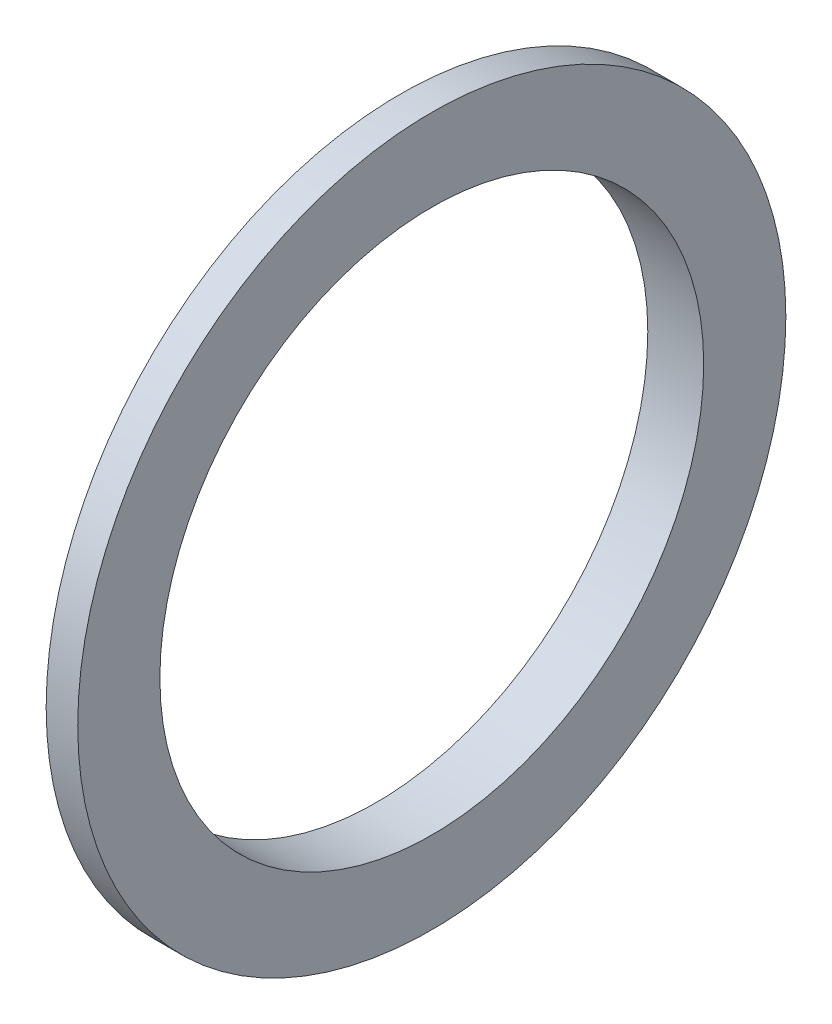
ISO-10303-21;
HEADER;
FILE_DESCRIPTION(('STEP AP214'),'2;1');
FILE_NAME('part.step','',(''),(''),'','','');
FILE_SCHEMA(('AUTOMOTIVE_DESIGN { 1 0 10303 214 1 1 1 1 }'));
ENDSEC;
DATA;
#1=APPLICATION_CONTEXT('core data for automotive mechanical design processes');
#2=APPLICATION_PROTOCOL_DEFINITION('international standard','automotive_design',2000,#1);
#3=PRODUCT_CONTEXT('',#1,'mechanical');
#4=PRODUCT('Part','Part','',(#3));
#5=PRODUCT_RELATED_PRODUCT_CATEGORY('part','',(#4));
#6=PRODUCT_DEFINITION_FORMATION('','',#4);
#7=PRODUCT_DEFINITION_CONTEXT('part definition',#1,'design');
#8=PRODUCT_DEFINITION('design','',#6,#7);
#9=PRODUCT_DEFINITION_SHAPE('','',#8);
#10=(LENGTH_UNIT() NAMED_UNIT(*) SI_UNIT(.MILLI.,.METRE.));
#11=(NAMED_UNIT(*) PLANE_ANGLE_UNIT() SI_UNIT($,.RADIAN.));
#12=(NAMED_UNIT(*) SI_UNIT($,.STERADIAN.) SOLID_ANGLE_UNIT());
#13=UNCERTAINTY_MEASURE_WITH_UNIT(LENGTH_MEASURE(1.E-05),#10,'distance_accuracy_value','');
#14=(GEOMETRIC_REPRESENTATION_CONTEXT(3) GLOBAL_UNCERTAINTY_ASSIGNED_CONTEXT((#13)) GLOBAL_UNIT_ASSIGNED_CONTEXT((#10,
#11,#12)) REPRESENTATION_CONTEXT('',''));
#15=CARTESIAN_POINT('',(0.,0.,0.));
#16=DIRECTION('',(0.,0.,1.));
#17=DIRECTION('',(1.,0.,0.));
#18=AXIS2_PLACEMENT_3D('',#15,#16,#17);
#19=CARTESIAN_POINT('',(0.,0.,0.));
#20=DIRECTION('',(1.,0.,0.));
#21=DIRECTION('',(0.,0.,-1.));
#22=AXIS2_PLACEMENT_3D('',#19,#20,#21);
#23=CYLINDRICAL_SURFACE('',#22,23.1648);
#24=CARTESIAN_POINT('',(0.,0.,0.));
#25=DIRECTION('',(1.,0.,0.));
#26=DIRECTION('',(0.,0.,-1.));
#27=AXIS2_PLACEMENT_3D('',#24,#25,#26);
#28=CIRCLE('',#27,23.1648);
#29=CARTESIAN_POINT('',(0.,0.,-23.1648));
#30=VERTEX_POINT('',#29);
#31=EDGE_CURVE('E10',#30,#30,#28,.T.);
#32=ORIENTED_EDGE('',*,*,#31,.T.);
#33=EDGE_LOOP('',(#32));
#34=FACE_BOUND('',#33,.T.);
#35=CARTESIAN_POINT('',(-4.7625,0.,0.));
#36=DIRECTION('',(1.,0.,0.));
#37=DIRECTION('',(0.,0.,-1.));
#38=AXIS2_PLACEMENT_3D('',#35,#36,#37);
#39=CIRCLE('',#38,23.1648);
#40=CARTESIAN_POINT('',(-4.7625,0.,-23.1648));
#41=VERTEX_POINT('',#40);
#42=EDGE_CURVE('E45',#41,#41,#39,.T.);
#43=ORIENTED_EDGE('',*,*,#42,.F.);
#44=EDGE_LOOP('',(#43));
#45=FACE_BOUND('',#44,.T.);
#46=ADVANCED_FACE('F31',(#34,#45),#23,.F.);
#47=CARTESIAN_POINT('',(0.,30.1625,0.));
#48=DIRECTION('',(1.,0.,0.));
#49=DIRECTION('',(0.,0.,-1.));
#50=AXIS2_PLACEMENT_3D('',#47,#48,#49);
#51=PLANE('',#50);
#52=CARTESIAN_POINT('',(0.,0.,0.));
#53=DIRECTION('',(1.,0.,0.));
#54=DIRECTION('',(0.,0.,-1.));
#55=AXIS2_PLACEMENT_3D('',#52,#53,#54);
#56=CIRCLE('',#55,30.1625);
#57=CARTESIAN_POINT('',(0.,0.,-30.1625));
#58=VERTEX_POINT('',#57);
#59=EDGE_CURVE('E37',#58,#58,#56,.T.);
#60=ORIENTED_EDGE('',*,*,#59,.T.);
#61=EDGE_LOOP('',(#60));
#62=FACE_BOUND('',#61,.T.);
#63=ORIENTED_EDGE('',*,*,#31,.F.);
#64=EDGE_LOOP('',(#63));
#65=FACE_BOUND('',#64,.T.);
#66=ADVANCED_FACE('F55',(#62,#65),#51,.T.);
#67=CARTESIAN_POINT('',(0.,0.,0.));
#68=DIRECTION('',(1.,0.,0.));
#69=DIRECTION('',(0.,0.,-1.));
#70=AXIS2_PLACEMENT_3D('',#67,#68,#69);
#71=CYLINDRICAL_SURFACE('',#70,30.1625);
#72=CARTESIAN_POINT('',(-2.6896868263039,0.,0.));
#73=DIRECTION('',(1.,0.,0.));
#74=DIRECTION('',(0.,0.,-1.));
#75=AXIS2_PLACEMENT_3D('',#72,#73,#74);
#76=CIRCLE('',#75,30.1625);
#77=CARTESIAN_POINT('',(-2.6896868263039,0.,-30.1625));
#78=VERTEX_POINT('',#77);
#79=EDGE_CURVE('E41',#78,#78,#76,.T.);
#80=ORIENTED_EDGE('',*,*,#79,.T.);
#81=EDGE_LOOP('',(#80));
#82=FACE_BOUND('',#81,.T.);
#83=ORIENTED_EDGE('',*,*,#59,.F.);
#84=EDGE_LOOP('',(#83));
#85=FACE_BOUND('',#84,.T.);
#86=ADVANCED_FACE('F59',(#82,#85),#71,.T.);
#87=CARTESIAN_POINT('',(-2.6896868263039,0.,0.));
#88=DIRECTION('',(1.,0.,0.));
#89=DIRECTION('',(0.,0.,-1.));
#90=AXIS2_PLACEMENT_3D('',#87,#88,#89);
#91=CONICAL_SURFACE('',#90,30.1625,1.28281700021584);
#92=ORIENTED_EDGE('',*,*,#42,.T.);
#93=EDGE_LOOP('',(#92));
#94=FACE_BOUND('',#93,.T.);
#95=ORIENTED_EDGE('',*,*,#79,.F.);
#96=EDGE_LOOP('',(#95));
#97=FACE_BOUND('',#96,.T.);
#98=ADVANCED_FACE('F51',(#94,#97),#91,.T.);
#99=CLOSED_SHELL('',(#46,#66,#86,#98));
#100=MANIFOLD_SOLID_BREP('B2',#99);
#101=ADVANCED_BREP_SHAPE_REPRESENTATION('',(#18,#100),#14);
#102=SHAPE_DEFINITION_REPRESENTATION(#9,#101);
ENDSEC;
END-ISO-10303-21;
